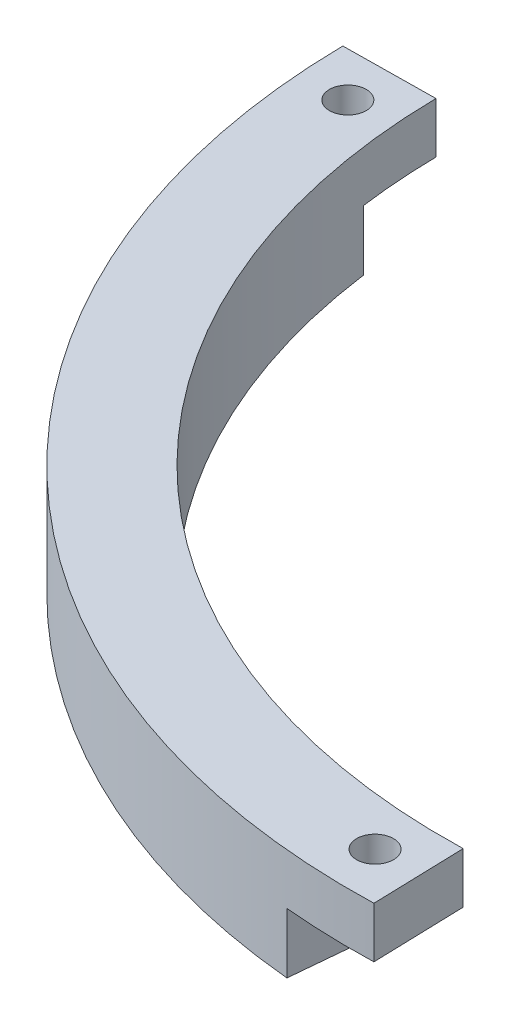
ISO-10303-21;
HEADER;
FILE_DESCRIPTION(('STEP AP214'),'2;1');
FILE_NAME('part.step','',(''),(''),'','','');
FILE_SCHEMA(('AUTOMOTIVE_DESIGN { 1 0 10303 214 1 1 1 1 }'));
ENDSEC;
DATA;
#1=APPLICATION_CONTEXT('core data for automotive mechanical design processes');
#2=APPLICATION_PROTOCOL_DEFINITION('international standard','automotive_design',2000,#1);
#3=PRODUCT_CONTEXT('',#1,'mechanical');
#4=PRODUCT('Part','Part','',(#3));
#5=PRODUCT_RELATED_PRODUCT_CATEGORY('part','',(#4));
#6=PRODUCT_DEFINITION_FORMATION('','',#4);
#7=PRODUCT_DEFINITION_CONTEXT('part definition',#1,'design');
#8=PRODUCT_DEFINITION('design','',#6,#7);
#9=PRODUCT_DEFINITION_SHAPE('','',#8);
#10=(LENGTH_UNIT() NAMED_UNIT(*) SI_UNIT(.MILLI.,.METRE.));
#11=(NAMED_UNIT(*) PLANE_ANGLE_UNIT() SI_UNIT($,.RADIAN.));
#12=(NAMED_UNIT(*) SI_UNIT($,.STERADIAN.) SOLID_ANGLE_UNIT());
#13=UNCERTAINTY_MEASURE_WITH_UNIT(LENGTH_MEASURE(1.E-05),#10,'distance_accuracy_value','');
#14=(GEOMETRIC_REPRESENTATION_CONTEXT(3) GLOBAL_UNCERTAINTY_ASSIGNED_CONTEXT((#13)) GLOBAL_UNIT_ASSIGNED_CONTEXT((#10,
#11,#12)) REPRESENTATION_CONTEXT('',''));
#15=CARTESIAN_POINT('',(0.,0.,0.));
#16=DIRECTION('',(0.,0.,1.));
#17=DIRECTION('',(1.,0.,0.));
#18=AXIS2_PLACEMENT_3D('',#15,#16,#17);
#19=CARTESIAN_POINT('',(0.,-44.6532,0.));
#20=DIRECTION('',(-0.0122170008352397,0.,-0.999925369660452));
#21=DIRECTION('',(-0.999925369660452,0.,0.0122170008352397));
#22=AXIS2_PLACEMENT_3D('',#19,#20,#21);
#23=PLANE('',#22);
#24=DIRECTION('',(0.,1.,0.));
#25=VECTOR('',#24,1.);
#26=CARTESIAN_POINT('',(-51.5581519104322,0.,0.629932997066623));
#27=LINE('',#26,#25);
#28=CARTESIAN_POINT('',(-51.5581519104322,-35.7632,0.629932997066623));
#29=VERTEX_POINT('',#28);
#30=CARTESIAN_POINT('',(-51.5581519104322,-39.8272,0.629932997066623));
#31=VERTEX_POINT('',#30);
#32=EDGE_CURVE('E164',#29,#31,#27,.F.);
#33=ORIENTED_EDGE('',*,*,#32,.T.);
#34=DIRECTION('',(-0.999925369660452,0.,0.0122170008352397));
#35=VECTOR('',#34,1.);
#36=CARTESIAN_POINT('',(0.,-39.8272,0.));
#37=LINE('',#36,#35);
#38=CARTESIAN_POINT('',(-58.9236021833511,-39.8272,0.71992342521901));
#39=VERTEX_POINT('',#38);
#40=EDGE_CURVE('E152',#31,#39,#37,.T.);
#41=ORIENTED_EDGE('',*,*,#40,.T.);
#42=DIRECTION('',(0.,1.,0.));
#43=VECTOR('',#42,1.);
#44=CARTESIAN_POINT('',(-58.9236021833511,-44.6532,0.71992342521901));
#45=LINE('',#44,#43);
#46=CARTESIAN_POINT('',(-58.9236021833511,-35.7632,0.71992342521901));
#47=VERTEX_POINT('',#46);
#48=EDGE_CURVE('E161',#39,#47,#45,.T.);
#49=ORIENTED_EDGE('',*,*,#48,.T.);
#50=DIRECTION('',(-0.999925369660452,0.,0.0122170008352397));
#51=VECTOR('',#50,1.);
#52=CARTESIAN_POINT('',(0.,-35.7632,0.));
#53=LINE('',#52,#51);
#54=EDGE_CURVE('E158',#29,#47,#53,.T.);
#55=ORIENTED_EDGE('',*,*,#54,.F.);
#56=EDGE_LOOP('',(#33,#41,#49,#55));
#57=FACE_BOUND('',#56,.T.);
#58=ADVANCED_FACE('F33',(#57),#23,.T.);
#59=CARTESIAN_POINT('',(0.,-44.6532,0.));
#60=DIRECTION('',(0.999559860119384,0.,-0.0296662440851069));
#61=DIRECTION('',(-0.0296662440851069,0.,-0.999559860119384));
#62=AXIS2_PLACEMENT_3D('',#59,#60,#61);
#63=PLANE('',#62);
#64=DIRECTION('',(0.,1.,0.));
#65=VECTOR('',#64,1.);
#66=CARTESIAN_POINT('',(1.74817243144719,-44.6532,58.9020634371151));
#67=LINE('',#66,#65);
#68=CARTESIAN_POINT('',(1.74817243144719,-39.8272,58.9020634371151));
#69=VERTEX_POINT('',#68);
#70=CARTESIAN_POINT('',(1.74817243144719,-35.7632,58.9020634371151));
#71=VERTEX_POINT('',#70);
#72=EDGE_CURVE('E162',#69,#71,#67,.T.);
#73=ORIENTED_EDGE('',*,*,#72,.F.);
#74=DIRECTION('',(-0.0296662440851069,0.,-0.999559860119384));
#75=VECTOR('',#74,1.);
#76=CARTESIAN_POINT('',(0.,-39.8272,0.));
#77=LINE('',#76,#75);
#78=CARTESIAN_POINT('',(1.5296508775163,-39.8272,51.5393055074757));
#79=VERTEX_POINT('',#78);
#80=EDGE_CURVE('E124',#69,#79,#77,.T.);
#81=ORIENTED_EDGE('',*,*,#80,.T.);
#82=DIRECTION('',(0.,1.,0.));
#83=VECTOR('',#82,1.);
#84=CARTESIAN_POINT('',(1.5296508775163,0.,51.5393055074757));
#85=LINE('',#84,#83);
#86=CARTESIAN_POINT('',(1.5296508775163,-35.7632,51.5393055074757));
#87=VERTEX_POINT('',#86);
#88=EDGE_CURVE('E168',#79,#87,#85,.T.);
#89=ORIENTED_EDGE('',*,*,#88,.T.);
#90=DIRECTION('',(-0.0296662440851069,0.,-0.999559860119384));
#91=VECTOR('',#90,1.);
#92=CARTESIAN_POINT('',(0.,-35.7632,0.));
#93=LINE('',#92,#91);
#94=EDGE_CURVE('E155',#71,#87,#93,.T.);
#95=ORIENTED_EDGE('',*,*,#94,.F.);
#96=EDGE_LOOP('',(#73,#81,#89,#95));
#97=FACE_BOUND('',#96,.T.);
#98=ADVANCED_FACE('F185',(#97),#63,.T.);
#99=CARTESIAN_POINT('',(0.,0.,0.));
#100=DIRECTION('',(0.,1.,0.));
#101=DIRECTION('',(0.,0.,1.));
#102=AXIS2_PLACEMENT_3D('',#99,#100,#101);
#103=CYLINDRICAL_SURFACE('',#102,58.928);
#104=CARTESIAN_POINT('',(0.,-39.8272,0.));
#105=DIRECTION('',(0.,-1.,0.));
#106=DIRECTION('',(0.,0.,-1.));
#107=AXIS2_PLACEMENT_3D('',#104,#105,#106);
#108=CIRCLE('',#107,58.928);
#109=CARTESIAN_POINT('',(-58.3966579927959,-39.8272,7.89553793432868));
#110=VERTEX_POINT('',#109);
#111=EDGE_CURVE('E50',#110,#39,#108,.T.);
#112=ORIENTED_EDGE('',*,*,#111,.F.);
#113=DIRECTION('',(0.,-1.,0.));
#114=VECTOR('',#113,1.);
#115=CARTESIAN_POINT('',(-58.3966579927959,-39.8272,7.89553793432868));
#116=LINE('',#115,#114);
#117=CARTESIAN_POINT('',(-58.3966579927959,-44.6532,7.89553793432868));
#118=VERTEX_POINT('',#117);
#119=EDGE_CURVE('E105',#110,#118,#116,.T.);
#120=ORIENTED_EDGE('',*,*,#119,.T.);
#121=CARTESIAN_POINT('',(0.,-44.6532,0.));
#122=DIRECTION('',(0.,1.,0.));
#123=DIRECTION('',(0.,0.,1.));
#124=AXIS2_PLACEMENT_3D('',#121,#122,#123);
#125=CIRCLE('',#124,58.928);
#126=CARTESIAN_POINT('',(-5.44321397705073,-44.6532,58.6760650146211));
#127=VERTEX_POINT('',#126);
#128=EDGE_CURVE('E118',#118,#127,#125,.T.);
#129=ORIENTED_EDGE('',*,*,#128,.T.);
#130=DIRECTION('',(0.,-1.,0.));
#131=VECTOR('',#130,1.);
#132=CARTESIAN_POINT('',(-5.44321397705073,-39.8272,58.6760650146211));
#133=LINE('',#132,#131);
#134=CARTESIAN_POINT('',(-5.44321397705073,-39.8272,58.6760650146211));
#135=VERTEX_POINT('',#134);
#136=EDGE_CURVE('E120',#135,#127,#133,.T.);
#137=ORIENTED_EDGE('',*,*,#136,.F.);
#138=EDGE_CURVE('E147',#69,#135,#108,.T.);
#139=ORIENTED_EDGE('',*,*,#138,.F.);
#140=ORIENTED_EDGE('',*,*,#72,.T.);
#141=CARTESIAN_POINT('',(0.,-35.7632,0.));
#142=DIRECTION('',(0.,1.,0.));
#143=DIRECTION('',(0.,0.,1.));
#144=AXIS2_PLACEMENT_3D('',#141,#142,#143);
#145=CIRCLE('',#144,58.928);
#146=EDGE_CURVE('E170',#47,#71,#145,.T.);
#147=ORIENTED_EDGE('',*,*,#146,.F.);
#148=ORIENTED_EDGE('',*,*,#48,.F.);
#149=EDGE_LOOP('',(#112,#120,#129,#137,#139,#140,#147,#148));
#150=FACE_BOUND('',#149,.T.);
#151=ADVANCED_FACE('F116',(#150),#103,.T.);
#152=CARTESIAN_POINT('',(20.1545630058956,-44.6532,-55.3742067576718));
#153=DIRECTION('',(0.,1.,0.));
#154=DIRECTION('',(0.,0.,1.));
#155=AXIS2_PLACEMENT_3D('',#152,#153,#154);
#156=PLANE('',#155);
#157=ORIENTED_EDGE('',*,*,#128,.F.);
#158=DIRECTION('',(-0.990983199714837,0.,0.133986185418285));
#159=VECTOR('',#158,1.);
#160=CARTESIAN_POINT('',(0.,-44.6532,0.));
#161=LINE('',#160,#159);
#162=CARTESIAN_POINT('',(-51.0970757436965,-44.6532,6.90859569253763));
#163=VERTEX_POINT('',#162);
#164=EDGE_CURVE('E101',#163,#118,#161,.T.);
#165=ORIENTED_EDGE('',*,*,#164,.F.);
#166=CARTESIAN_POINT('',(0.,-44.6532,0.));
#167=DIRECTION('',(0.,1.,0.));
#168=DIRECTION('',(0.,0.,1.));
#169=AXIS2_PLACEMENT_3D('',#166,#167,#168);
#170=CIRCLE('',#169,51.562);
#171=CARTESIAN_POINT('',(-4.76281222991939,-44.6532,51.3415568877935));
#172=VERTEX_POINT('',#171);
#173=EDGE_CURVE('E125',#163,#172,#170,.T.);
#174=ORIENTED_EDGE('',*,*,#173,.T.);
#175=DIRECTION('',(0.0923705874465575,0.,-0.995724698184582));
#176=VECTOR('',#175,1.);
#177=CARTESIAN_POINT('',(0.,-44.6532,0.));
#178=LINE('',#177,#176);
#179=EDGE_CURVE('E111',#127,#172,#178,.T.);
#180=ORIENTED_EDGE('',*,*,#179,.F.);
#181=EDGE_LOOP('',(#157,#165,#174,#180));
#182=FACE_BOUND('',#181,.T.);
#183=ADVANCED_FACE('F35',(#182),#156,.F.);
#184=CARTESIAN_POINT('',(0.,0.,0.));
#185=DIRECTION('',(0.,1.,0.));
#186=DIRECTION('',(0.,0.,1.));
#187=AXIS2_PLACEMENT_3D('',#184,#185,#186);
#188=CYLINDRICAL_SURFACE('',#187,51.562);
#189=CARTESIAN_POINT('',(0.,-39.8272,0.));
#190=DIRECTION('',(0.,-1.,0.));
#191=DIRECTION('',(0.,0.,-1.));
#192=AXIS2_PLACEMENT_3D('',#189,#190,#191);
#193=CIRCLE('',#192,51.562);
#194=CARTESIAN_POINT('',(-4.76281222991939,-39.8272,51.3415568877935));
#195=VERTEX_POINT('',#194);
#196=EDGE_CURVE('E58',#195,#79,#193,.F.);
#197=ORIENTED_EDGE('',*,*,#196,.F.);
#198=DIRECTION('',(0.,1.,0.));
#199=VECTOR('',#198,1.);
#200=CARTESIAN_POINT('',(-4.76281222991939,0.,51.3415568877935));
#201=LINE('',#200,#199);
#202=EDGE_CURVE('E12',#195,#172,#201,.F.);
#203=ORIENTED_EDGE('',*,*,#202,.T.);
#204=ORIENTED_EDGE('',*,*,#173,.F.);
#205=DIRECTION('',(0.,1.,0.));
#206=VECTOR('',#205,1.);
#207=CARTESIAN_POINT('',(-51.0970757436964,0.,6.9085956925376));
#208=LINE('',#207,#206);
#209=CARTESIAN_POINT('',(-51.0970757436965,-39.8272,6.90859569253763));
#210=VERTEX_POINT('',#209);
#211=EDGE_CURVE('E42',#163,#210,#208,.T.);
#212=ORIENTED_EDGE('',*,*,#211,.T.);
#213=EDGE_CURVE('E153',#31,#210,#193,.F.);
#214=ORIENTED_EDGE('',*,*,#213,.F.);
#215=ORIENTED_EDGE('',*,*,#32,.F.);
#216=CARTESIAN_POINT('',(0.,-35.7632,0.));
#217=DIRECTION('',(0.,1.,0.));
#218=DIRECTION('',(0.,0.,1.));
#219=AXIS2_PLACEMENT_3D('',#216,#217,#218);
#220=CIRCLE('',#219,51.562);
#221=EDGE_CURVE('E128',#29,#87,#220,.T.);
#222=ORIENTED_EDGE('',*,*,#221,.T.);
#223=ORIENTED_EDGE('',*,*,#88,.F.);
#224=EDGE_LOOP('',(#197,#203,#204,#212,#214,#215,#222,#223));
#225=FACE_BOUND('',#224,.T.);
#226=ADVANCED_FACE('F177',(#225),#188,.F.);
#227=CARTESIAN_POINT('',(20.1545630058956,-35.7632,-55.3742067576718));
#228=DIRECTION('',(0.,-1.,0.));
#229=DIRECTION('',(0.,0.,-1.));
#230=AXIS2_PLACEMENT_3D('',#227,#228,#229);
#231=PLANE('',#230);
#232=CARTESIAN_POINT('',(-54.9774049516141,-35.7632,4.26273546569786));
#233=DIRECTION('',(0.,1.,0.));
#234=DIRECTION('',(0.,0.,1.));
#235=AXIS2_PLACEMENT_3D('',#232,#233,#234);
#236=CIRCLE('',#235,1.47319999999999);
#237=CARTESIAN_POINT('',(-54.9774049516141,-35.7632,5.73593546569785));
#238=VERTEX_POINT('',#237);
#239=EDGE_CURVE('E141',#238,#238,#236,.T.);
#240=ORIENTED_EDGE('',*,*,#239,.F.);
#241=EDGE_LOOP('',(#240));
#242=FACE_BOUND('',#241,.T.);
#243=CARTESIAN_POINT('',(-1.95678154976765,-35.7632,55.1076852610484));
#244=DIRECTION('',(0.,1.,0.));
#245=DIRECTION('',(0.,0.,1.));
#246=AXIS2_PLACEMENT_3D('',#243,#244,#245);
#247=CIRCLE('',#246,1.47319999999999);
#248=CARTESIAN_POINT('',(-1.95678154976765,-35.7632,56.5808852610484));
#249=VERTEX_POINT('',#248);
#250=EDGE_CURVE('E133',#249,#249,#247,.T.);
#251=ORIENTED_EDGE('',*,*,#250,.F.);
#252=EDGE_LOOP('',(#251));
#253=FACE_BOUND('',#252,.T.);
#254=ORIENTED_EDGE('',*,*,#94,.T.);
#255=ORIENTED_EDGE('',*,*,#221,.F.);
#256=ORIENTED_EDGE('',*,*,#54,.T.);
#257=ORIENTED_EDGE('',*,*,#146,.T.);
#258=EDGE_LOOP('',(#254,#255,#256,#257));
#259=FACE_BOUND('',#258,.T.);
#260=ADVANCED_FACE('F180',(#242,#253,#259),#231,.F.);
#261=CARTESIAN_POINT('',(0.,-39.8272,0.));
#262=DIRECTION('',(0.,-1.,0.));
#263=DIRECTION('',(0.,0.,-1.));
#264=AXIS2_PLACEMENT_3D('',#261,#262,#263);
#265=PLANE('',#264);
#266=CARTESIAN_POINT('',(-1.95678154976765,-39.8272,55.1076852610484));
#267=DIRECTION('',(0.,-1.,0.));
#268=DIRECTION('',(0.,0.,-1.));
#269=AXIS2_PLACEMENT_3D('',#266,#267,#268);
#270=CIRCLE('',#269,1.47319999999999);
#271=CARTESIAN_POINT('',(-1.95678154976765,-39.8272,53.6344852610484));
#272=VERTEX_POINT('',#271);
#273=EDGE_CURVE('E112',#272,#272,#270,.T.);
#274=ORIENTED_EDGE('',*,*,#273,.F.);
#275=EDGE_LOOP('',(#274));
#276=FACE_BOUND('',#275,.T.);
#277=ORIENTED_EDGE('',*,*,#196,.T.);
#278=ORIENTED_EDGE('',*,*,#80,.F.);
#279=ORIENTED_EDGE('',*,*,#138,.T.);
#280=DIRECTION('',(0.0923705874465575,0.,-0.995724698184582));
#281=VECTOR('',#280,1.);
#282=CARTESIAN_POINT('',(0.,-39.8272,0.));
#283=LINE('',#282,#281);
#284=EDGE_CURVE('E121',#135,#195,#283,.T.);
#285=ORIENTED_EDGE('',*,*,#284,.T.);
#286=EDGE_LOOP('',(#277,#278,#279,#285));
#287=FACE_BOUND('',#286,.T.);
#288=ADVANCED_FACE('F187',(#276,#287),#265,.T.);
#289=CARTESIAN_POINT('',(0.,-39.8272,0.));
#290=DIRECTION('',(-0.995724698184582,0.,-0.0923705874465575));
#291=DIRECTION('',(-0.0923705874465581,0.,0.995724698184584));
#292=AXIS2_PLACEMENT_3D('',#289,#290,#291);
#293=PLANE('',#292);
#294=ORIENTED_EDGE('',*,*,#284,.F.);
#295=ORIENTED_EDGE('',*,*,#136,.T.);
#296=ORIENTED_EDGE('',*,*,#179,.T.);
#297=ORIENTED_EDGE('',*,*,#202,.F.);
#298=EDGE_LOOP('',(#294,#295,#296,#297));
#299=FACE_BOUND('',#298,.T.);
#300=ADVANCED_FACE('F190',(#299),#293,.F.);
#301=CARTESIAN_POINT('',(0.,-39.8272,0.));
#302=DIRECTION('',(0.133986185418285,0.,0.990983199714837));
#303=DIRECTION('',(0.990983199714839,0.,-0.133986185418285));
#304=AXIS2_PLACEMENT_3D('',#301,#302,#303);
#305=PLANE('',#304);
#306=ORIENTED_EDGE('',*,*,#164,.T.);
#307=ORIENTED_EDGE('',*,*,#119,.F.);
#308=DIRECTION('',(-0.990983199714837,0.,0.133986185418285));
#309=VECTOR('',#308,1.);
#310=CARTESIAN_POINT('',(0.,-39.8272,0.));
#311=LINE('',#310,#309);
#312=EDGE_CURVE('E145',#210,#110,#311,.T.);
#313=ORIENTED_EDGE('',*,*,#312,.F.);
#314=ORIENTED_EDGE('',*,*,#211,.F.);
#315=EDGE_LOOP('',(#306,#307,#313,#314));
#316=FACE_BOUND('',#315,.T.);
#317=ADVANCED_FACE('F103',(#316),#305,.F.);
#318=CARTESIAN_POINT('',(-54.9774049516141,-39.8272,4.26273546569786));
#319=DIRECTION('',(0.,-1.,0.));
#320=DIRECTION('',(0.,0.,-1.));
#321=AXIS2_PLACEMENT_3D('',#318,#319,#320);
#322=CIRCLE('',#321,1.47319999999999);
#323=CARTESIAN_POINT('',(-54.9774049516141,-39.8272,2.78953546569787));
#324=VERTEX_POINT('',#323);
#325=EDGE_CURVE('E37',#324,#324,#322,.T.);
#326=ORIENTED_EDGE('',*,*,#325,.F.);
#327=EDGE_LOOP('',(#326));
#328=FACE_BOUND('',#327,.T.);
#329=ORIENTED_EDGE('',*,*,#213,.T.);
#330=ORIENTED_EDGE('',*,*,#312,.T.);
#331=ORIENTED_EDGE('',*,*,#111,.T.);
#332=ORIENTED_EDGE('',*,*,#40,.F.);
#333=EDGE_LOOP('',(#329,#330,#331,#332));
#334=FACE_BOUND('',#333,.T.);
#335=ADVANCED_FACE('F192',(#328,#334),#265,.T.);
#336=CARTESIAN_POINT('',(-1.95678154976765,-35.7632,55.1076852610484));
#337=DIRECTION('',(0.,1.,0.));
#338=DIRECTION('',(0.,0.,1.));
#339=AXIS2_PLACEMENT_3D('',#336,#337,#338);
#340=CYLINDRICAL_SURFACE('',#339,1.47319999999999);
#341=ORIENTED_EDGE('',*,*,#273,.T.);
#342=EDGE_LOOP('',(#341));
#343=FACE_BOUND('',#342,.T.);
#344=ORIENTED_EDGE('',*,*,#250,.T.);
#345=EDGE_LOOP('',(#344));
#346=FACE_BOUND('',#345,.T.);
#347=ADVANCED_FACE('F194',(#343,#346),#340,.F.);
#348=CARTESIAN_POINT('',(-54.9774049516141,-35.7632,4.26273546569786));
#349=DIRECTION('',(0.,1.,0.));
#350=DIRECTION('',(0.,0.,1.));
#351=AXIS2_PLACEMENT_3D('',#348,#349,#350);
#352=CYLINDRICAL_SURFACE('',#351,1.47319999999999);
#353=ORIENTED_EDGE('',*,*,#325,.T.);
#354=EDGE_LOOP('',(#353));
#355=FACE_BOUND('',#354,.T.);
#356=ORIENTED_EDGE('',*,*,#239,.T.);
#357=EDGE_LOOP('',(#356));
#358=FACE_BOUND('',#357,.T.);
#359=ADVANCED_FACE('F201',(#355,#358),#352,.F.);
#360=CLOSED_SHELL('',(#58,#98,#151,#183,#226,#260,#288,#300,#317,#335,#347,#359));
#361=MANIFOLD_SOLID_BREP('B2',#360);
#362=ADVANCED_BREP_SHAPE_REPRESENTATION('',(#18,#361),#14);
#363=SHAPE_DEFINITION_REPRESENTATION(#9,#362);
ENDSEC;
END-ISO-10303-21;
